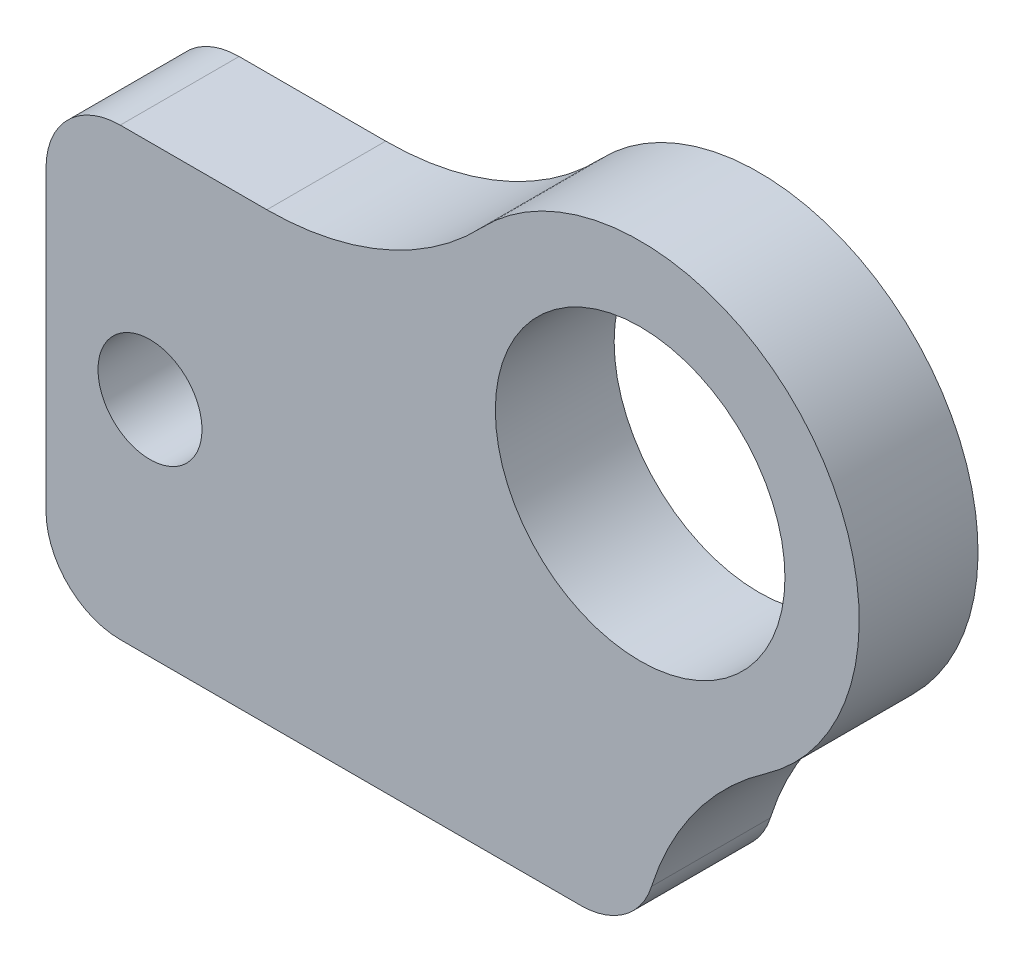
ISO-10303-21;
HEADER;
FILE_DESCRIPTION(('STEP AP214'),'2;1');
FILE_NAME('part.step','',(''),(''),'','','');
FILE_SCHEMA(('AUTOMOTIVE_DESIGN { 1 0 10303 214 1 1 1 1 }'));
ENDSEC;
DATA;
#1=APPLICATION_CONTEXT('core data for automotive mechanical design processes');
#2=APPLICATION_PROTOCOL_DEFINITION('international standard','automotive_design',2000,#1);
#3=PRODUCT_CONTEXT('',#1,'mechanical');
#4=PRODUCT('Part','Part','',(#3));
#5=PRODUCT_RELATED_PRODUCT_CATEGORY('part','',(#4));
#6=PRODUCT_DEFINITION_FORMATION('','',#4);
#7=PRODUCT_DEFINITION_CONTEXT('part definition',#1,'design');
#8=PRODUCT_DEFINITION('design','',#6,#7);
#9=PRODUCT_DEFINITION_SHAPE('','',#8);
#10=(LENGTH_UNIT() NAMED_UNIT(*) SI_UNIT(.MILLI.,.METRE.));
#11=(NAMED_UNIT(*) PLANE_ANGLE_UNIT() SI_UNIT($,.RADIAN.));
#12=(NAMED_UNIT(*) SI_UNIT($,.STERADIAN.) SOLID_ANGLE_UNIT());
#13=UNCERTAINTY_MEASURE_WITH_UNIT(LENGTH_MEASURE(1.E-05),#10,'distance_accuracy_value','');
#14=(GEOMETRIC_REPRESENTATION_CONTEXT(3) GLOBAL_UNCERTAINTY_ASSIGNED_CONTEXT((#13)) GLOBAL_UNIT_ASSIGNED_CONTEXT((#10,
#11,#12)) REPRESENTATION_CONTEXT('',''));
#15=CARTESIAN_POINT('',(0.,0.,0.));
#16=DIRECTION('',(0.,0.,1.));
#17=DIRECTION('',(1.,0.,0.));
#18=AXIS2_PLACEMENT_3D('',#15,#16,#17);
#19=CARTESIAN_POINT('',(40.,26.,0.));
#20=DIRECTION('',(0.,0.,1.));
#21=DIRECTION('',(1.,0.,0.));
#22=AXIS2_PLACEMENT_3D('',#19,#20,#21);
#23=PLANE('',#22);
#24=CARTESIAN_POINT('',(7.,15.,0.));
#25=DIRECTION('',(0.,0.,-1.));
#26=DIRECTION('',(-1.,0.,0.));
#27=AXIS2_PLACEMENT_3D('',#24,#25,#26);
#28=CIRCLE('',#27,3.5);
#29=CARTESIAN_POINT('',(3.5,15.,0.));
#30=VERTEX_POINT('',#29);
#31=EDGE_CURVE('E141',#30,#30,#28,.F.);
#32=ORIENTED_EDGE('',*,*,#31,.T.);
#33=EDGE_LOOP('',(#32));
#34=FACE_BOUND('',#33,.T.);
#35=CARTESIAN_POINT('',(40.,26.,0.));
#36=DIRECTION('',(0.,0.,-1.));
#37=DIRECTION('',(-1.,0.,0.));
#38=AXIS2_PLACEMENT_3D('',#35,#36,#37);
#39=CIRCLE('',#38,9.75);
#40=CARTESIAN_POINT('',(30.25,26.,0.));
#41=VERTEX_POINT('',#40);
#42=EDGE_CURVE('E20',#41,#41,#39,.F.);
#43=ORIENTED_EDGE('',*,*,#42,.T.);
#44=EDGE_LOOP('',(#43));
#45=FACE_BOUND('',#44,.T.);
#46=CARTESIAN_POINT('',(5.,5.,0.));
#47=DIRECTION('',(0.,0.,-1.));
#48=DIRECTION('',(-1.,0.,0.));
#49=AXIS2_PLACEMENT_3D('',#46,#47,#48);
#50=CIRCLE('',#49,5.);
#51=CARTESIAN_POINT('',(0.,5.,0.));
#52=VERTEX_POINT('',#51);
#53=CARTESIAN_POINT('',(5.,0.,0.));
#54=VERTEX_POINT('',#53);
#55=EDGE_CURVE('E91',#52,#54,#50,.F.);
#56=ORIENTED_EDGE('',*,*,#55,.F.);
#57=DIRECTION('',(0.,1.,0.));
#58=VECTOR('',#57,1.);
#59=CARTESIAN_POINT('',(0.,0.,0.));
#60=LINE('',#59,#58);
#61=CARTESIAN_POINT('',(0.,25.,0.));
#62=VERTEX_POINT('',#61);
#63=EDGE_CURVE('E84',#52,#62,#60,.T.);
#64=ORIENTED_EDGE('',*,*,#63,.T.);
#65=CARTESIAN_POINT('',(5.,25.,0.));
#66=DIRECTION('',(0.,0.,-1.));
#67=DIRECTION('',(-1.,0.,0.));
#68=AXIS2_PLACEMENT_3D('',#65,#66,#67);
#69=CIRCLE('',#68,5.);
#70=CARTESIAN_POINT('',(5.,30.,0.));
#71=VERTEX_POINT('',#70);
#72=EDGE_CURVE('E145',#71,#62,#69,.F.);
#73=ORIENTED_EDGE('',*,*,#72,.F.);
#74=DIRECTION('',(1.,0.,0.));
#75=VECTOR('',#74,1.);
#76=CARTESIAN_POINT('',(0.,30.,0.));
#77=LINE('',#76,#75);
#78=CARTESIAN_POINT('',(14.8690927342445,30.,0.));
#79=VERTEX_POINT('',#78);
#80=EDGE_CURVE('E116',#71,#79,#77,.T.);
#81=ORIENTED_EDGE('',*,*,#80,.T.);
#82=CARTESIAN_POINT('',(14.8690927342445,50.,0.));
#83=DIRECTION('',(0.,0.,-1.));
#84=DIRECTION('',(-1.,0.,0.));
#85=AXIS2_PLACEMENT_3D('',#82,#83,#84);
#86=CIRCLE('',#85,20.);
#87=CARTESIAN_POINT('',(29.3329242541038,36.1870503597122,0.));
#88=VERTEX_POINT('',#87);
#89=EDGE_CURVE('E148',#79,#88,#86,.F.);
#90=ORIENTED_EDGE('',*,*,#89,.T.);
#91=CARTESIAN_POINT('',(40.,26.,0.));
#92=DIRECTION('',(0.,0.,-1.));
#93=DIRECTION('',(-1.,0.,0.));
#94=AXIS2_PLACEMENT_3D('',#91,#92,#93);
#95=CIRCLE('',#94,14.75);
#96=CARTESIAN_POINT('',(48.4210088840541,13.8901234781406,0.));
#97=VERTEX_POINT('',#96);
#98=EDGE_CURVE('E151',#97,#88,#95,.F.);
#99=ORIENTED_EDGE('',*,*,#98,.F.);
#100=CARTESIAN_POINT('',(59.8393260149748,-2.53004807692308,0.));
#101=DIRECTION('',(0.,0.,1.));
#102=DIRECTION('',(1.,0.,0.));
#103=AXIS2_PLACEMENT_3D('',#100,#101,#102);
#104=CIRCLE('',#103,20.);
#105=CARTESIAN_POINT('',(40.7681183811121,3.49399038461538,0.));
#106=VERTEX_POINT('',#105);
#107=EDGE_CURVE('E155',#97,#106,#104,.T.);
#108=ORIENTED_EDGE('',*,*,#107,.T.);
#109=CARTESIAN_POINT('',(36.0003164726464,5.,0.));
#110=DIRECTION('',(0.,0.,1.));
#111=DIRECTION('',(1.,0.,0.));
#112=AXIS2_PLACEMENT_3D('',#109,#110,#111);
#113=CIRCLE('',#112,5.);
#114=CARTESIAN_POINT('',(36.0003164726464,0.,0.));
#115=VERTEX_POINT('',#114);
#116=EDGE_CURVE('E94',#115,#106,#113,.T.);
#117=ORIENTED_EDGE('',*,*,#116,.F.);
#118=DIRECTION('',(1.,0.,0.));
#119=VECTOR('',#118,1.);
#120=CARTESIAN_POINT('',(0.,0.,0.));
#121=LINE('',#120,#119);
#122=EDGE_CURVE('E89',#115,#54,#121,.F.);
#123=ORIENTED_EDGE('',*,*,#122,.T.);
#124=EDGE_LOOP('',(#56,#64,#73,#81,#90,#99,#108,#117,#123));
#125=FACE_BOUND('',#124,.T.);
#126=ADVANCED_FACE('F17',(#34,#45,#125),#23,.F.);
#127=CARTESIAN_POINT('',(40.,26.,8.));
#128=DIRECTION('',(0.,0.,-1.));
#129=DIRECTION('',(-1.,0.,0.));
#130=AXIS2_PLACEMENT_3D('',#127,#128,#129);
#131=CYLINDRICAL_SURFACE('',#130,9.75);
#132=CARTESIAN_POINT('',(40.,26.,8.));
#133=DIRECTION('',(0.,0.,-1.));
#134=DIRECTION('',(-1.,0.,0.));
#135=AXIS2_PLACEMENT_3D('',#132,#133,#134);
#136=CIRCLE('',#135,9.75);
#137=CARTESIAN_POINT('',(30.25,26.,8.));
#138=VERTEX_POINT('',#137);
#139=EDGE_CURVE('E138',#138,#138,#136,.T.);
#140=ORIENTED_EDGE('',*,*,#139,.F.);
#141=EDGE_LOOP('',(#140));
#142=FACE_BOUND('',#141,.T.);
#143=ORIENTED_EDGE('',*,*,#42,.F.);
#144=EDGE_LOOP('',(#143));
#145=FACE_BOUND('',#144,.T.);
#146=ADVANCED_FACE('F287',(#142,#145),#131,.F.);
#147=CARTESIAN_POINT('',(0.,0.,8.));
#148=DIRECTION('',(1.,0.,0.));
#149=DIRECTION('',(0.,0.,-1.));
#150=AXIS2_PLACEMENT_3D('',#147,#148,#149);
#151=PLANE('',#150);
#152=DIRECTION('',(0.,0.,-1.));
#153=VECTOR('',#152,1.);
#154=CARTESIAN_POINT('',(0.,5.,8.));
#155=LINE('',#154,#153);
#156=CARTESIAN_POINT('',(0.,5.,8.));
#157=VERTEX_POINT('',#156);
#158=EDGE_CURVE('E104',#157,#52,#155,.T.);
#159=ORIENTED_EDGE('',*,*,#158,.F.);
#160=DIRECTION('',(0.,1.,0.));
#161=VECTOR('',#160,1.);
#162=CARTESIAN_POINT('',(0.,26.,8.));
#163=LINE('',#162,#161);
#164=CARTESIAN_POINT('',(0.,25.,8.));
#165=VERTEX_POINT('',#164);
#166=EDGE_CURVE('E137',#165,#157,#163,.F.);
#167=ORIENTED_EDGE('',*,*,#166,.F.);
#168=DIRECTION('',(0.,0.,-1.));
#169=VECTOR('',#168,1.);
#170=CARTESIAN_POINT('',(0.,25.,8.));
#171=LINE('',#170,#169);
#172=EDGE_CURVE('E144',#62,#165,#171,.F.);
#173=ORIENTED_EDGE('',*,*,#172,.F.);
#174=ORIENTED_EDGE('',*,*,#63,.F.);
#175=EDGE_LOOP('',(#159,#167,#173,#174));
#176=FACE_BOUND('',#175,.T.);
#177=ADVANCED_FACE('F190',(#176),#151,.F.);
#178=CARTESIAN_POINT('',(5.,5.,8.));
#179=DIRECTION('',(0.,0.,-1.));
#180=DIRECTION('',(-1.,0.,0.));
#181=AXIS2_PLACEMENT_3D('',#178,#179,#180);
#182=CYLINDRICAL_SURFACE('',#181,5.);
#183=ORIENTED_EDGE('',*,*,#55,.T.);
#184=DIRECTION('',(0.,0.,1.));
#185=VECTOR('',#184,1.);
#186=CARTESIAN_POINT('',(5.,0.,8.));
#187=LINE('',#186,#185);
#188=CARTESIAN_POINT('',(5.,0.,8.));
#189=VERTEX_POINT('',#188);
#190=EDGE_CURVE('E98',#54,#189,#187,.T.);
#191=ORIENTED_EDGE('',*,*,#190,.T.);
#192=CARTESIAN_POINT('',(5.,5.,8.));
#193=DIRECTION('',(0.,0.,-1.));
#194=DIRECTION('',(-1.,0.,0.));
#195=AXIS2_PLACEMENT_3D('',#192,#193,#194);
#196=CIRCLE('',#195,5.);
#197=EDGE_CURVE('E135',#157,#189,#196,.F.);
#198=ORIENTED_EDGE('',*,*,#197,.F.);
#199=ORIENTED_EDGE('',*,*,#158,.T.);
#200=EDGE_LOOP('',(#183,#191,#198,#199));
#201=FACE_BOUND('',#200,.T.);
#202=ADVANCED_FACE('F101',(#201),#182,.T.);
#203=CARTESIAN_POINT('',(0.,0.,8.));
#204=DIRECTION('',(0.,1.,0.));
#205=DIRECTION('',(0.,0.,1.));
#206=AXIS2_PLACEMENT_3D('',#203,#204,#205);
#207=PLANE('',#206);
#208=ORIENTED_EDGE('',*,*,#190,.F.);
#209=ORIENTED_EDGE('',*,*,#122,.F.);
#210=DIRECTION('',(0.,0.,1.));
#211=VECTOR('',#210,1.);
#212=CARTESIAN_POINT('',(36.0003164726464,0.,8.));
#213=LINE('',#212,#211);
#214=CARTESIAN_POINT('',(36.0003164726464,0.,8.));
#215=VERTEX_POINT('',#214);
#216=EDGE_CURVE('E109',#215,#115,#213,.F.);
#217=ORIENTED_EDGE('',*,*,#216,.F.);
#218=DIRECTION('',(1.,0.,0.));
#219=VECTOR('',#218,1.);
#220=CARTESIAN_POINT('',(40.,0.,8.));
#221=LINE('',#220,#219);
#222=EDGE_CURVE('E107',#189,#215,#221,.T.);
#223=ORIENTED_EDGE('',*,*,#222,.F.);
#224=EDGE_LOOP('',(#208,#209,#217,#223));
#225=FACE_BOUND('',#224,.T.);
#226=ADVANCED_FACE('F105',(#225),#207,.F.);
#227=CARTESIAN_POINT('',(36.0003164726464,5.,8.));
#228=DIRECTION('',(0.,0.,1.));
#229=DIRECTION('',(1.,0.,0.));
#230=AXIS2_PLACEMENT_3D('',#227,#228,#229);
#231=CYLINDRICAL_SURFACE('',#230,5.);
#232=ORIENTED_EDGE('',*,*,#116,.T.);
#233=DIRECTION('',(0.,0.,1.));
#234=VECTOR('',#233,1.);
#235=CARTESIAN_POINT('',(40.7681183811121,3.49399038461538,8.));
#236=LINE('',#235,#234);
#237=CARTESIAN_POINT('',(40.7681183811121,3.49399038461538,8.));
#238=VERTEX_POINT('',#237);
#239=EDGE_CURVE('E157',#106,#238,#236,.T.);
#240=ORIENTED_EDGE('',*,*,#239,.T.);
#241=CARTESIAN_POINT('',(36.0003164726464,5.,8.));
#242=DIRECTION('',(0.,0.,1.));
#243=DIRECTION('',(1.,0.,0.));
#244=AXIS2_PLACEMENT_3D('',#241,#242,#243);
#245=CIRCLE('',#244,5.);
#246=EDGE_CURVE('E132',#215,#238,#245,.T.);
#247=ORIENTED_EDGE('',*,*,#246,.F.);
#248=ORIENTED_EDGE('',*,*,#216,.T.);
#249=EDGE_LOOP('',(#232,#240,#247,#248));
#250=FACE_BOUND('',#249,.T.);
#251=ADVANCED_FACE('F160',(#250),#231,.T.);
#252=CARTESIAN_POINT('',(59.8393260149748,-2.53004807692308,8.));
#253=DIRECTION('',(0.,0.,1.));
#254=DIRECTION('',(1.,0.,0.));
#255=AXIS2_PLACEMENT_3D('',#252,#253,#254);
#256=CYLINDRICAL_SURFACE('',#255,20.);
#257=ORIENTED_EDGE('',*,*,#239,.F.);
#258=ORIENTED_EDGE('',*,*,#107,.F.);
#259=DIRECTION('',(0.,0.,-1.));
#260=VECTOR('',#259,1.);
#261=CARTESIAN_POINT('',(48.4210088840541,13.8901234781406,8.));
#262=LINE('',#261,#260);
#263=CARTESIAN_POINT('',(48.4210088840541,13.8901234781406,8.));
#264=VERTEX_POINT('',#263);
#265=EDGE_CURVE('E154',#264,#97,#262,.T.);
#266=ORIENTED_EDGE('',*,*,#265,.F.);
#267=CARTESIAN_POINT('',(59.8393260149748,-2.53004807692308,8.));
#268=DIRECTION('',(0.,0.,1.));
#269=DIRECTION('',(1.,0.,0.));
#270=AXIS2_PLACEMENT_3D('',#267,#268,#269);
#271=CIRCLE('',#270,20.);
#272=EDGE_CURVE('E129',#238,#264,#271,.F.);
#273=ORIENTED_EDGE('',*,*,#272,.F.);
#274=EDGE_LOOP('',(#257,#258,#266,#273));
#275=FACE_BOUND('',#274,.T.);
#276=ADVANCED_FACE('F164',(#275),#256,.F.);
#277=CARTESIAN_POINT('',(40.,26.,8.));
#278=DIRECTION('',(0.,0.,-1.));
#279=DIRECTION('',(-1.,0.,0.));
#280=AXIS2_PLACEMENT_3D('',#277,#278,#279);
#281=CYLINDRICAL_SURFACE('',#280,14.75);
#282=ORIENTED_EDGE('',*,*,#98,.T.);
#283=DIRECTION('',(0.,0.,-1.));
#284=VECTOR('',#283,1.);
#285=CARTESIAN_POINT('',(29.3329242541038,36.1870503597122,8.));
#286=LINE('',#285,#284);
#287=CARTESIAN_POINT('',(29.3329242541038,36.1870503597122,8.));
#288=VERTEX_POINT('',#287);
#289=EDGE_CURVE('E150',#88,#288,#286,.F.);
#290=ORIENTED_EDGE('',*,*,#289,.T.);
#291=CARTESIAN_POINT('',(40.,26.,8.));
#292=DIRECTION('',(0.,0.,-1.));
#293=DIRECTION('',(-1.,0.,0.));
#294=AXIS2_PLACEMENT_3D('',#291,#292,#293);
#295=CIRCLE('',#294,14.75);
#296=EDGE_CURVE('E126',#264,#288,#295,.F.);
#297=ORIENTED_EDGE('',*,*,#296,.F.);
#298=ORIENTED_EDGE('',*,*,#265,.T.);
#299=EDGE_LOOP('',(#282,#290,#297,#298));
#300=FACE_BOUND('',#299,.T.);
#301=ADVANCED_FACE('F193',(#300),#281,.T.);
#302=CARTESIAN_POINT('',(14.8690927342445,50.,8.));
#303=DIRECTION('',(0.,0.,-1.));
#304=DIRECTION('',(-1.,0.,0.));
#305=AXIS2_PLACEMENT_3D('',#302,#303,#304);
#306=CYLINDRICAL_SURFACE('',#305,20.);
#307=ORIENTED_EDGE('',*,*,#289,.F.);
#308=ORIENTED_EDGE('',*,*,#89,.F.);
#309=DIRECTION('',(0.,0.,-1.));
#310=VECTOR('',#309,1.);
#311=CARTESIAN_POINT('',(14.8690927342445,30.,8.));
#312=LINE('',#311,#310);
#313=CARTESIAN_POINT('',(14.8690927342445,30.,8.));
#314=VERTEX_POINT('',#313);
#315=EDGE_CURVE('E118',#79,#314,#312,.F.);
#316=ORIENTED_EDGE('',*,*,#315,.T.);
#317=CARTESIAN_POINT('',(14.8690927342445,50.,8.));
#318=DIRECTION('',(0.,0.,-1.));
#319=DIRECTION('',(-1.,0.,0.));
#320=AXIS2_PLACEMENT_3D('',#317,#318,#319);
#321=CIRCLE('',#320,20.);
#322=EDGE_CURVE('E123',#288,#314,#321,.T.);
#323=ORIENTED_EDGE('',*,*,#322,.F.);
#324=EDGE_LOOP('',(#307,#308,#316,#323));
#325=FACE_BOUND('',#324,.T.);
#326=ADVANCED_FACE('F187',(#325),#306,.F.);
#327=CARTESIAN_POINT('',(0.,30.,8.));
#328=DIRECTION('',(0.,-1.,0.));
#329=DIRECTION('',(0.,0.,-1.));
#330=AXIS2_PLACEMENT_3D('',#327,#328,#329);
#331=PLANE('',#330);
#332=DIRECTION('',(0.,0.,-1.));
#333=VECTOR('',#332,1.);
#334=CARTESIAN_POINT('',(5.,30.,8.));
#335=LINE('',#334,#333);
#336=CARTESIAN_POINT('',(5.,30.,8.));
#337=VERTEX_POINT('',#336);
#338=EDGE_CURVE('E35',#337,#71,#335,.T.);
#339=ORIENTED_EDGE('',*,*,#338,.F.);
#340=DIRECTION('',(1.,0.,0.));
#341=VECTOR('',#340,1.);
#342=CARTESIAN_POINT('',(40.,30.,8.));
#343=LINE('',#342,#341);
#344=EDGE_CURVE('E122',#314,#337,#343,.F.);
#345=ORIENTED_EDGE('',*,*,#344,.F.);
#346=ORIENTED_EDGE('',*,*,#315,.F.);
#347=ORIENTED_EDGE('',*,*,#80,.F.);
#348=EDGE_LOOP('',(#339,#345,#346,#347));
#349=FACE_BOUND('',#348,.T.);
#350=ADVANCED_FACE('F183',(#349),#331,.F.);
#351=CARTESIAN_POINT('',(5.,25.,8.));
#352=DIRECTION('',(0.,0.,-1.));
#353=DIRECTION('',(-1.,0.,0.));
#354=AXIS2_PLACEMENT_3D('',#351,#352,#353);
#355=CYLINDRICAL_SURFACE('',#354,5.);
#356=ORIENTED_EDGE('',*,*,#72,.T.);
#357=ORIENTED_EDGE('',*,*,#172,.T.);
#358=CARTESIAN_POINT('',(5.,25.,8.));
#359=DIRECTION('',(0.,0.,-1.));
#360=DIRECTION('',(-1.,0.,0.));
#361=AXIS2_PLACEMENT_3D('',#358,#359,#360);
#362=CIRCLE('',#361,5.);
#363=EDGE_CURVE('E26',#337,#165,#362,.F.);
#364=ORIENTED_EDGE('',*,*,#363,.F.);
#365=ORIENTED_EDGE('',*,*,#338,.T.);
#366=EDGE_LOOP('',(#356,#357,#364,#365));
#367=FACE_BOUND('',#366,.T.);
#368=ADVANCED_FACE('F189',(#367),#355,.T.);
#369=CARTESIAN_POINT('',(7.,15.,8.));
#370=DIRECTION('',(0.,0.,-1.));
#371=DIRECTION('',(-1.,0.,0.));
#372=AXIS2_PLACEMENT_3D('',#369,#370,#371);
#373=CYLINDRICAL_SURFACE('',#372,3.5);
#374=CARTESIAN_POINT('',(7.,15.,8.));
#375=DIRECTION('',(0.,0.,-1.));
#376=DIRECTION('',(-1.,0.,0.));
#377=AXIS2_PLACEMENT_3D('',#374,#375,#376);
#378=CIRCLE('',#377,3.5);
#379=CARTESIAN_POINT('',(3.5,15.,8.));
#380=VERTEX_POINT('',#379);
#381=EDGE_CURVE('E11',#380,#380,#378,.T.);
#382=ORIENTED_EDGE('',*,*,#381,.F.);
#383=EDGE_LOOP('',(#382));
#384=FACE_BOUND('',#383,.T.);
#385=ORIENTED_EDGE('',*,*,#31,.F.);
#386=EDGE_LOOP('',(#385));
#387=FACE_BOUND('',#386,.T.);
#388=ADVANCED_FACE('F204',(#384,#387),#373,.F.);
#389=CARTESIAN_POINT('',(40.,26.,8.));
#390=DIRECTION('',(0.,0.,1.));
#391=DIRECTION('',(1.,0.,0.));
#392=AXIS2_PLACEMENT_3D('',#389,#390,#391);
#393=PLANE('',#392);
#394=ORIENTED_EDGE('',*,*,#381,.T.);
#395=EDGE_LOOP('',(#394));
#396=FACE_BOUND('',#395,.T.);
#397=ORIENTED_EDGE('',*,*,#344,.T.);
#398=ORIENTED_EDGE('',*,*,#363,.T.);
#399=ORIENTED_EDGE('',*,*,#166,.T.);
#400=ORIENTED_EDGE('',*,*,#197,.T.);
#401=ORIENTED_EDGE('',*,*,#222,.T.);
#402=ORIENTED_EDGE('',*,*,#246,.T.);
#403=ORIENTED_EDGE('',*,*,#272,.T.);
#404=ORIENTED_EDGE('',*,*,#296,.T.);
#405=ORIENTED_EDGE('',*,*,#322,.T.);
#406=EDGE_LOOP('',(#397,#398,#399,#400,#401,#402,#403,#404,#405));
#407=FACE_BOUND('',#406,.T.);
#408=ORIENTED_EDGE('',*,*,#139,.T.);
#409=EDGE_LOOP('',(#408));
#410=FACE_BOUND('',#409,.T.);
#411=ADVANCED_FACE('F179',(#396,#407,#410),#393,.T.);
#412=CLOSED_SHELL('',(#126,#146,#177,#202,#226,#251,#276,#301,#326,#350,#368,#388,#411));
#413=MANIFOLD_SOLID_BREP('B1',#412);
#414=ADVANCED_BREP_SHAPE_REPRESENTATION('',(#18,#413),#14);
#415=SHAPE_DEFINITION_REPRESENTATION(#9,#414);
ENDSEC;
END-ISO-10303-21;
